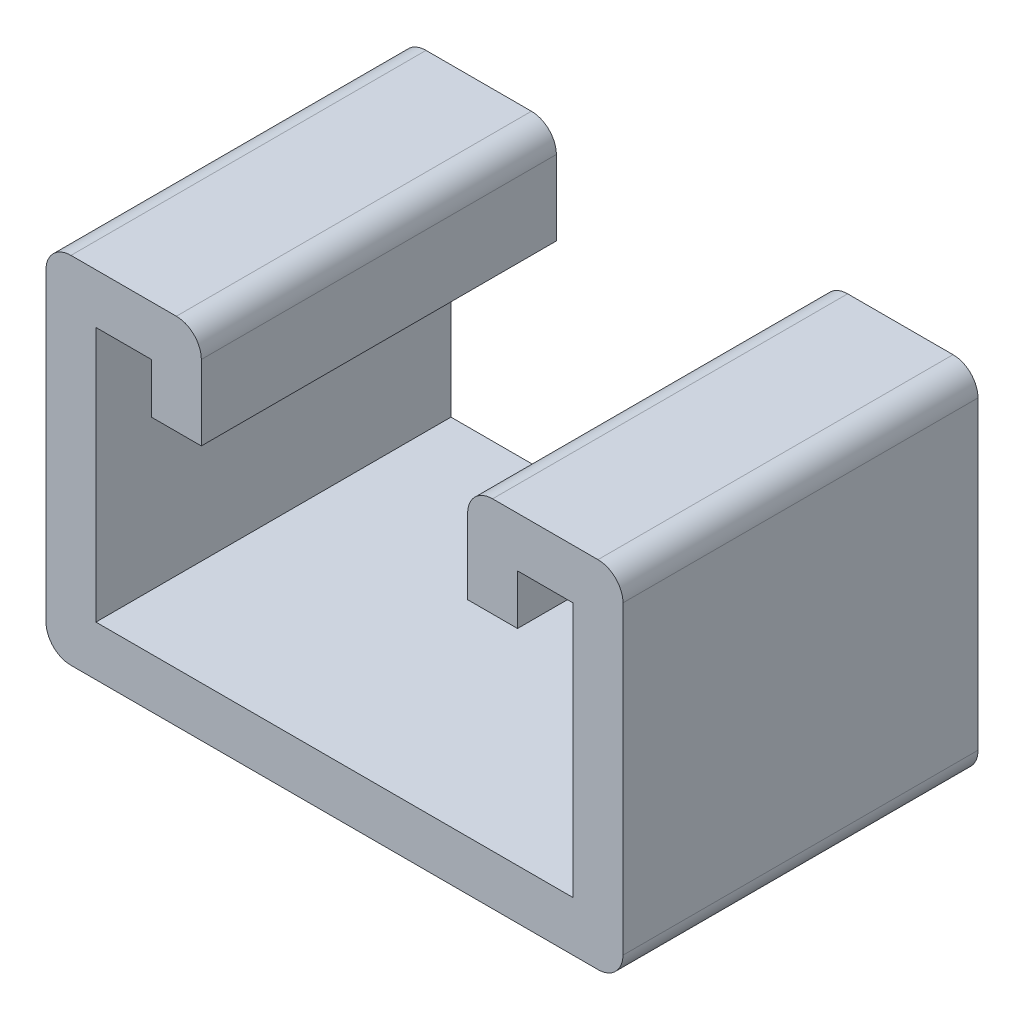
from build123d import *

# Parameters (mm, degrees)
BASE_EXTRUDE_DEPTH = 12.7


with BuildPart() as part:
    # Sketch1 → Base-Extrude (new, symmetric)
    with BuildSketch(Plane.XY):
        with BuildLine():
            Line((-11.3109375, 12.7), (-18.8515625, 12.7))
            ThreePointArc((-18.8515625, 12.7), (-20.114411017, 12.176911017), (-20.6375, 10.9140625))
            Line((-20.6375, 10.9140625), (-20.6375, -10.9140625))
            ThreePointArc((-20.6375, -10.9140625), (-20.114411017, -12.176911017), (-18.8515625, -12.7))
            Line((-18.8515625, -12.7), (18.8515625, -12.7))
            ThreePointArc((18.8515625, -12.7), (20.114411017, -12.176911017), (20.6375, -10.9140625))
            Line((20.6375, -10.9140625), (20.6375, 10.9140625))
            ThreePointArc((20.6375, 10.9140625), (20.114411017, 12.176911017), (18.8515625, 12.7))
            Line((18.8515625, 12.7), (11.3109375, 12.7))
            ThreePointArc((11.3109375, 12.7), (10.048088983, 12.176911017), (9.525, 10.9140625))
            Line((9.525, 10.9140625), (9.525, 5.55625))
            Line((9.525, 5.55625), (13.096875, 5.55625))
            Line((13.096875, 5.55625), (13.096875, 9.128125))
            Line((13.096875, 9.128125), (17.065625, 9.128125))
            Line((17.065625, 9.128125), (17.065625, -9.128125))
            Line((17.065625, -9.128125), (-17.065625, -9.128125))
            Line((-17.065625, -9.128125), (-17.065625, 9.128125))
            Line((-17.065625, 9.128125), (-13.096875, 9.128125))
            Line((-13.096875, 9.128125), (-13.096875, 5.55625))
            Line((-13.096875, 5.55625), (-9.525, 5.55625))
            Line((-9.525, 5.55625), (-9.525, 10.9140625))
            ThreePointArc((-9.525, 10.9140625), (-10.048088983, 12.176911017), (-11.3109375, 12.7))
        make_face()
    extrude(amount=BASE_EXTRUDE_DEPTH, both=True)


solid = part.part
